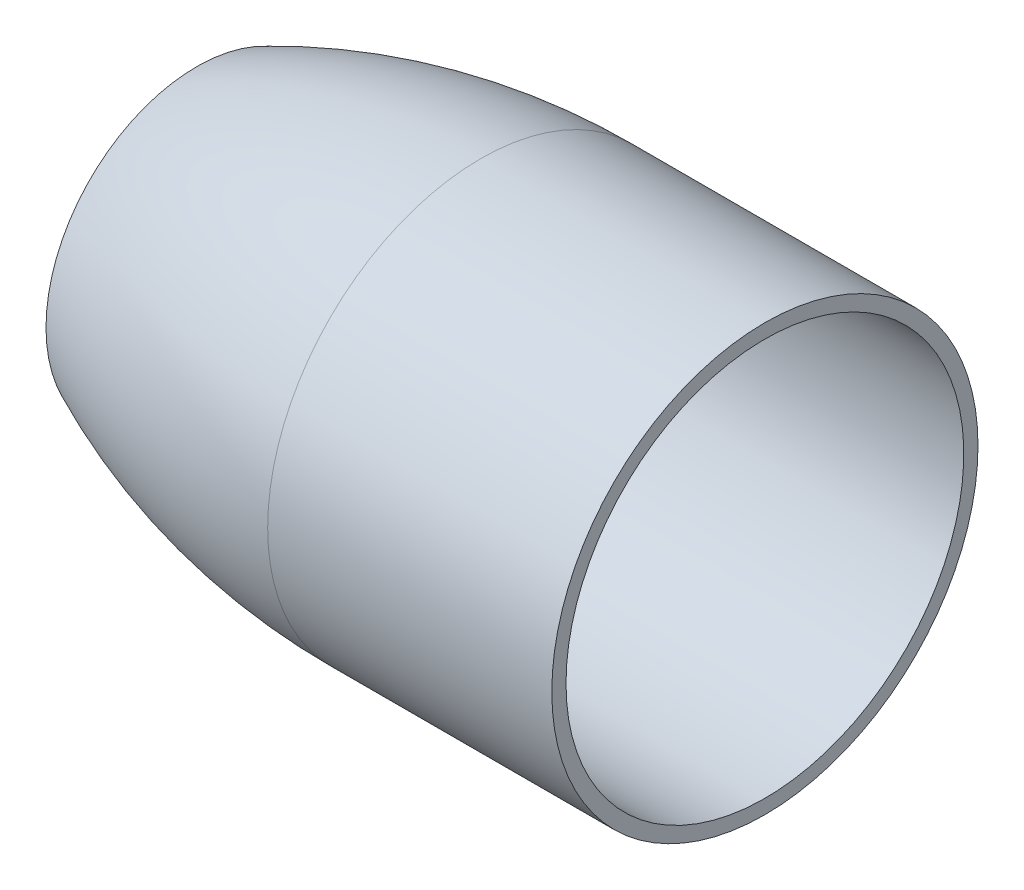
ISO-10303-21;
HEADER;
FILE_DESCRIPTION(('STEP AP214'),'2;1');
FILE_NAME('part.step','',(''),(''),'','','');
FILE_SCHEMA(('AUTOMOTIVE_DESIGN { 1 0 10303 214 1 1 1 1 }'));
ENDSEC;
DATA;
#1=APPLICATION_CONTEXT('core data for automotive mechanical design processes');
#2=APPLICATION_PROTOCOL_DEFINITION('international standard','automotive_design',2000,#1);
#3=PRODUCT_CONTEXT('',#1,'mechanical');
#4=PRODUCT('Part','Part','',(#3));
#5=PRODUCT_RELATED_PRODUCT_CATEGORY('part','',(#4));
#6=PRODUCT_DEFINITION_FORMATION('','',#4);
#7=PRODUCT_DEFINITION_CONTEXT('part definition',#1,'design');
#8=PRODUCT_DEFINITION('design','',#6,#7);
#9=PRODUCT_DEFINITION_SHAPE('','',#8);
#10=(LENGTH_UNIT() NAMED_UNIT(*) SI_UNIT(.MILLI.,.METRE.));
#11=(NAMED_UNIT(*) PLANE_ANGLE_UNIT() SI_UNIT($,.RADIAN.));
#12=(NAMED_UNIT(*) SI_UNIT($,.STERADIAN.) SOLID_ANGLE_UNIT());
#13=UNCERTAINTY_MEASURE_WITH_UNIT(LENGTH_MEASURE(1.E-05),#10,'distance_accuracy_value','');
#14=(GEOMETRIC_REPRESENTATION_CONTEXT(3) GLOBAL_UNCERTAINTY_ASSIGNED_CONTEXT((#13)) GLOBAL_UNIT_ASSIGNED_CONTEXT((#10,
#11,#12)) REPRESENTATION_CONTEXT('',''));
#15=CARTESIAN_POINT('',(0.,0.,0.));
#16=DIRECTION('',(0.,0.,1.));
#17=DIRECTION('',(1.,0.,0.));
#18=AXIS2_PLACEMENT_3D('',#15,#16,#17);
#19=CARTESIAN_POINT('',(-53.8909327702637,0.,0.));
#20=DIRECTION('',(-1.,0.,0.));
#21=DIRECTION('',(0.,0.,1.));
#22=AXIS2_PLACEMENT_3D('',#19,#20,#21);
#23=CYLINDRICAL_SURFACE('',#22,14.);
#24=CARTESIAN_POINT('',(0.,0.,0.));
#25=DIRECTION('',(-1.,0.,0.));
#26=DIRECTION('',(0.,0.,1.));
#27=AXIS2_PLACEMENT_3D('',#24,#25,#26);
#28=CIRCLE('',#27,14.);
#29=CARTESIAN_POINT('',(0.,0.,14.));
#30=VERTEX_POINT('',#29);
#31=EDGE_CURVE('E10',#30,#30,#28,.T.);
#32=ORIENTED_EDGE('',*,*,#31,.F.);
#33=EDGE_LOOP('',(#32));
#34=FACE_BOUND('',#33,.T.);
#35=CARTESIAN_POINT('',(-20.,0.,0.));
#36=DIRECTION('',(-1.,0.,0.));
#37=DIRECTION('',(0.,0.,1.));
#38=AXIS2_PLACEMENT_3D('',#35,#36,#37);
#39=CIRCLE('',#38,14.);
#40=CARTESIAN_POINT('',(-20.,0.,14.));
#41=VERTEX_POINT('',#40);
#42=EDGE_CURVE('E55',#41,#41,#39,.T.);
#43=ORIENTED_EDGE('',*,*,#42,.T.);
#44=EDGE_LOOP('',(#43));
#45=FACE_BOUND('',#44,.T.);
#46=ADVANCED_FACE('F33',(#34,#45),#23,.F.);
#47=CARTESIAN_POINT('',(0.,14.,0.));
#48=DIRECTION('',(-1.,0.,0.));
#49=DIRECTION('',(0.,0.,1.));
#50=AXIS2_PLACEMENT_3D('',#47,#48,#49);
#51=PLANE('',#50);
#52=CARTESIAN_POINT('',(0.,0.,0.));
#53=DIRECTION('',(-1.,0.,0.));
#54=DIRECTION('',(0.,0.,1.));
#55=AXIS2_PLACEMENT_3D('',#52,#53,#54);
#56=CIRCLE('',#55,15.);
#57=CARTESIAN_POINT('',(0.,0.,15.));
#58=VERTEX_POINT('',#57);
#59=EDGE_CURVE('E39',#58,#58,#56,.T.);
#60=ORIENTED_EDGE('',*,*,#59,.F.);
#61=EDGE_LOOP('',(#60));
#62=FACE_BOUND('',#61,.T.);
#63=ORIENTED_EDGE('',*,*,#31,.T.);
#64=EDGE_LOOP('',(#63));
#65=FACE_BOUND('',#64,.T.);
#66=ADVANCED_FACE('F80',(#62,#65),#51,.F.);
#67=CARTESIAN_POINT('',(-53.8909327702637,0.,0.));
#68=DIRECTION('',(-1.,0.,0.));
#69=DIRECTION('',(0.,0.,1.));
#70=AXIS2_PLACEMENT_3D('',#67,#68,#69);
#71=CYLINDRICAL_SURFACE('',#70,15.);
#72=CARTESIAN_POINT('',(-20.,0.,0.));
#73=DIRECTION('',(-1.,0.,0.));
#74=DIRECTION('',(0.,0.,1.));
#75=AXIS2_PLACEMENT_3D('',#72,#73,#74);
#76=CIRCLE('',#75,15.);
#77=CARTESIAN_POINT('',(-20.,0.,15.));
#78=VERTEX_POINT('',#77);
#79=EDGE_CURVE('E43',#78,#78,#76,.T.);
#80=ORIENTED_EDGE('',*,*,#79,.F.);
#81=EDGE_LOOP('',(#80));
#82=FACE_BOUND('',#81,.T.);
#83=ORIENTED_EDGE('',*,*,#59,.T.);
#84=EDGE_LOOP('',(#83));
#85=FACE_BOUND('',#84,.T.);
#86=ADVANCED_FACE('F75',(#82,#85),#71,.T.);
#87=CARTESIAN_POINT('',(-20.,0.,0.));
#88=DIRECTION('',(-1.,0.,0.));
#89=DIRECTION('',(0.,0.,1.));
#90=AXIS2_PLACEMENT_3D('',#87,#88,#89);
#91=DEGENERATE_TOROIDAL_SURFACE('',#90,32.69,47.69,.F.);
#92=CARTESIAN_POINT('',(-40.,0.,0.));
#93=DIRECTION('',(-1.,0.,0.));
#94=DIRECTION('',(0.,0.,1.));
#95=AXIS2_PLACEMENT_3D('',#92,#93,#94);
#96=CIRCLE('',#95,10.6036034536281);
#97=CARTESIAN_POINT('',(-40.,0.,10.6036034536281));
#98=VERTEX_POINT('',#97);
#99=EDGE_CURVE('E47',#98,#98,#96,.T.);
#100=ORIENTED_EDGE('',*,*,#99,.F.);
#101=EDGE_LOOP('',(#100));
#102=FACE_BOUND('',#101,.T.);
#103=ORIENTED_EDGE('',*,*,#79,.T.);
#104=EDGE_LOOP('',(#103));
#105=FACE_BOUND('',#104,.T.);
#106=ADVANCED_FACE('F69',(#102,#105),#91,.F.);
#107=CARTESIAN_POINT('',(-40.,9.49952595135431,0.));
#108=DIRECTION('',(1.,0.,0.));
#109=DIRECTION('',(0.,0.,-1.));
#110=AXIS2_PLACEMENT_3D('',#107,#108,#109);
#111=PLANE('',#110);
#112=CARTESIAN_POINT('',(-40.,0.,0.));
#113=DIRECTION('',(-1.,0.,0.));
#114=DIRECTION('',(0.,0.,1.));
#115=AXIS2_PLACEMENT_3D('',#112,#113,#114);
#116=CIRCLE('',#115,9.49952595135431);
#117=CARTESIAN_POINT('',(-40.,0.,9.49952595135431));
#118=VERTEX_POINT('',#117);
#119=EDGE_CURVE('E52',#118,#118,#116,.T.);
#120=ORIENTED_EDGE('',*,*,#119,.F.);
#121=EDGE_LOOP('',(#120));
#122=FACE_BOUND('',#121,.T.);
#123=ORIENTED_EDGE('',*,*,#99,.T.);
#124=EDGE_LOOP('',(#123));
#125=FACE_BOUND('',#124,.T.);
#126=ADVANCED_FACE('F63',(#122,#125),#111,.F.);
#127=CARTESIAN_POINT('',(-20.,0.,0.));
#128=DIRECTION('',(-1.,0.,0.));
#129=DIRECTION('',(0.,0.,1.));
#130=AXIS2_PLACEMENT_3D('',#127,#128,#129);
#131=DEGENERATE_TOROIDAL_SURFACE('',#130,32.69,46.69,.F.);
#132=ORIENTED_EDGE('',*,*,#42,.F.);
#133=EDGE_LOOP('',(#132));
#134=FACE_BOUND('',#133,.T.);
#135=ORIENTED_EDGE('',*,*,#119,.T.);
#136=EDGE_LOOP('',(#135));
#137=FACE_BOUND('',#136,.T.);
#138=ADVANCED_FACE('F60',(#134,#137),#131,.T.);
#139=CLOSED_SHELL('',(#46,#66,#86,#106,#126,#138));
#140=MANIFOLD_SOLID_BREP('B2',#139);
#141=ADVANCED_BREP_SHAPE_REPRESENTATION('',(#18,#140),#14);
#142=SHAPE_DEFINITION_REPRESENTATION(#9,#141);
ENDSEC;
END-ISO-10303-21;
